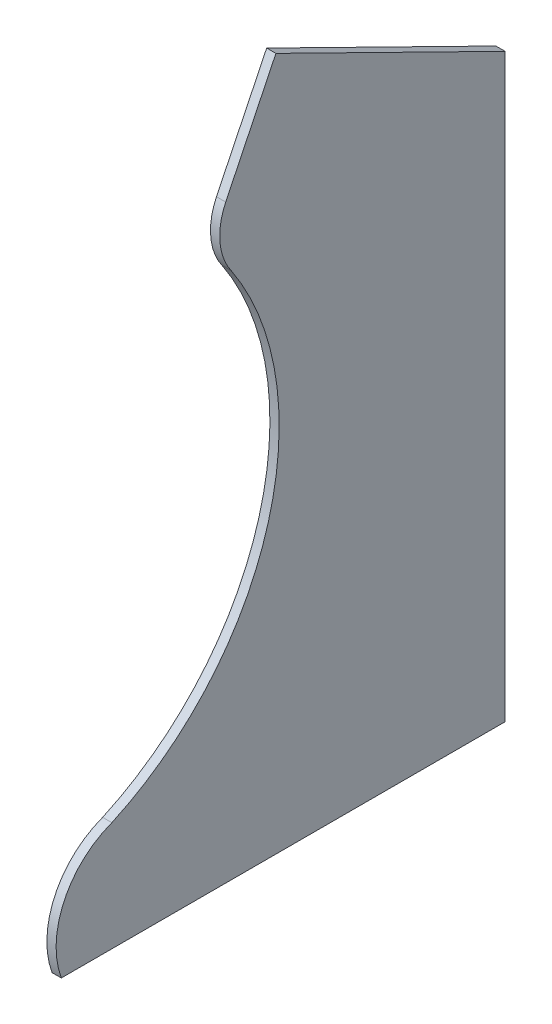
ISO-10303-21;
HEADER;
FILE_DESCRIPTION(('STEP AP214'),'2;1');
FILE_NAME('part.step','',(''),(''),'','','');
FILE_SCHEMA(('AUTOMOTIVE_DESIGN { 1 0 10303 214 1 1 1 1 }'));
ENDSEC;
DATA;
#1=APPLICATION_CONTEXT('core data for automotive mechanical design processes');
#2=APPLICATION_PROTOCOL_DEFINITION('international standard','automotive_design',2000,#1);
#3=PRODUCT_CONTEXT('',#1,'mechanical');
#4=PRODUCT('Part','Part','',(#3));
#5=PRODUCT_RELATED_PRODUCT_CATEGORY('part','',(#4));
#6=PRODUCT_DEFINITION_FORMATION('','',#4);
#7=PRODUCT_DEFINITION_CONTEXT('part definition',#1,'design');
#8=PRODUCT_DEFINITION('design','',#6,#7);
#9=PRODUCT_DEFINITION_SHAPE('','',#8);
#10=(LENGTH_UNIT() NAMED_UNIT(*) SI_UNIT(.MILLI.,.METRE.));
#11=(NAMED_UNIT(*) PLANE_ANGLE_UNIT() SI_UNIT($,.RADIAN.));
#12=(NAMED_UNIT(*) SI_UNIT($,.STERADIAN.) SOLID_ANGLE_UNIT());
#13=UNCERTAINTY_MEASURE_WITH_UNIT(LENGTH_MEASURE(1.E-05),#10,'distance_accuracy_value','');
#14=(GEOMETRIC_REPRESENTATION_CONTEXT(3) GLOBAL_UNCERTAINTY_ASSIGNED_CONTEXT((#13)) GLOBAL_UNIT_ASSIGNED_CONTEXT((#10,
#11,#12)) REPRESENTATION_CONTEXT('',''));
#15=CARTESIAN_POINT('',(0.,0.,0.));
#16=DIRECTION('',(0.,0.,1.));
#17=DIRECTION('',(1.,0.,0.));
#18=AXIS2_PLACEMENT_3D('',#15,#16,#17);
#19=CARTESIAN_POINT('',(10.,-736.54579363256,83.6938727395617));
#20=DIRECTION('',(-1.,0.,0.));
#21=DIRECTION('',(0.,0.,1.));
#22=AXIS2_PLACEMENT_3D('',#19,#20,#21);
#23=CYLINDRICAL_SURFACE('',#22,92.1635376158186);
#24=CARTESIAN_POINT('',(0.,-736.54579363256,83.6938727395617));
#25=DIRECTION('',(1.,0.,0.));
#26=DIRECTION('',(0.,0.,-1.));
#27=AXIS2_PLACEMENT_3D('',#24,#25,#26);
#28=CIRCLE('',#27,92.1635376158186);
#29=CARTESIAN_POINT('',(0.,-650.03330709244,115.469765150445));
#30=VERTEX_POINT('',#29);
#31=CARTESIAN_POINT('',(0.,-768.321686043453,170.206359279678));
#32=VERTEX_POINT('',#31);
#33=EDGE_CURVE('E125',#30,#32,#28,.T.);
#34=ORIENTED_EDGE('',*,*,#33,.T.);
#35=DIRECTION('',(-1.,0.,0.));
#36=VECTOR('',#35,1.);
#37=CARTESIAN_POINT('',(10.,-768.321686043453,170.206359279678));
#38=LINE('',#37,#36);
#39=CARTESIAN_POINT('',(10.,-768.321686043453,170.206359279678));
#40=VERTEX_POINT('',#39);
#41=EDGE_CURVE('E11',#40,#32,#38,.T.);
#42=ORIENTED_EDGE('',*,*,#41,.F.);
#43=CARTESIAN_POINT('',(10.,-736.54579363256,83.6938727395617));
#44=DIRECTION('',(1.,0.,0.));
#45=DIRECTION('',(0.,0.,-1.));
#46=AXIS2_PLACEMENT_3D('',#43,#44,#45);
#47=CIRCLE('',#46,92.1635376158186);
#48=CARTESIAN_POINT('',(10.,-650.03330709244,115.469765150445));
#49=VERTEX_POINT('',#48);
#50=EDGE_CURVE('E137',#49,#40,#47,.T.);
#51=ORIENTED_EDGE('',*,*,#50,.F.);
#52=DIRECTION('',(-1.,0.,0.));
#53=VECTOR('',#52,1.);
#54=CARTESIAN_POINT('',(10.,-650.03330709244,115.469765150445));
#55=LINE('',#54,#53);
#56=EDGE_CURVE('E121',#49,#30,#55,.T.);
#57=ORIENTED_EDGE('',*,*,#56,.T.);
#58=EDGE_LOOP('',(#34,#42,#51,#57));
#59=FACE_BOUND('',#58,.T.);
#60=ADVANCED_FACE('F35',(#59),#23,.T.);
#61=CARTESIAN_POINT('',(10.,-768.321686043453,170.206359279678));
#62=DIRECTION('',(0.,1.,0.));
#63=DIRECTION('',(0.,0.,1.));
#64=AXIS2_PLACEMENT_3D('',#61,#62,#63);
#65=PLANE('',#64);
#66=DIRECTION('',(0.,0.,-1.));
#67=VECTOR('',#66,1.);
#68=CARTESIAN_POINT('',(0.,-768.321686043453,170.206359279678));
#69=LINE('',#68,#67);
#70=CARTESIAN_POINT('',(0.,-768.321686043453,-310.283640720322));
#71=VERTEX_POINT('',#70);
#72=EDGE_CURVE('E128',#32,#71,#69,.T.);
#73=ORIENTED_EDGE('',*,*,#72,.T.);
#74=DIRECTION('',(-1.,0.,0.));
#75=VECTOR('',#74,1.);
#76=CARTESIAN_POINT('',(10.,-768.321686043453,-310.283640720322));
#77=LINE('',#76,#75);
#78=CARTESIAN_POINT('',(10.,-768.321686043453,-310.283640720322));
#79=VERTEX_POINT('',#78);
#80=EDGE_CURVE('E43',#79,#71,#77,.T.);
#81=ORIENTED_EDGE('',*,*,#80,.F.);
#82=DIRECTION('',(0.,0.,-1.));
#83=VECTOR('',#82,1.);
#84=CARTESIAN_POINT('',(10.,-768.321686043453,170.206359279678));
#85=LINE('',#84,#83);
#86=EDGE_CURVE('E91',#40,#79,#85,.T.);
#87=ORIENTED_EDGE('',*,*,#86,.F.);
#88=ORIENTED_EDGE('',*,*,#41,.T.);
#89=EDGE_LOOP('',(#73,#81,#87,#88));
#90=FACE_BOUND('',#89,.T.);
#91=ADVANCED_FACE('F162',(#90),#65,.F.);
#92=CARTESIAN_POINT('',(10.,-768.321686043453,-310.283640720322));
#93=DIRECTION('',(0.,0.,1.));
#94=DIRECTION('',(0.,-1.,0.));
#95=AXIS2_PLACEMENT_3D('',#92,#93,#94);
#96=PLANE('',#95);
#97=DIRECTION('',(0.,1.,0.));
#98=VECTOR('',#97,1.);
#99=CARTESIAN_POINT('',(0.,-768.321686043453,-310.283640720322));
#100=LINE('',#99,#98);
#101=CARTESIAN_POINT('',(0.,-139.724382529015,-310.283640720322));
#102=VERTEX_POINT('',#101);
#103=EDGE_CURVE('E130',#71,#102,#100,.T.);
#104=ORIENTED_EDGE('',*,*,#103,.T.);
#105=DIRECTION('',(-1.,0.,0.));
#106=VECTOR('',#105,1.);
#107=CARTESIAN_POINT('',(10.,-139.724382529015,-310.283640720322));
#108=LINE('',#107,#106);
#109=CARTESIAN_POINT('',(10.,-139.724382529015,-310.283640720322));
#110=VERTEX_POINT('',#109);
#111=EDGE_CURVE('E141',#110,#102,#108,.T.);
#112=ORIENTED_EDGE('',*,*,#111,.F.);
#113=DIRECTION('',(0.,1.,0.));
#114=VECTOR('',#113,1.);
#115=CARTESIAN_POINT('',(10.,-768.321686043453,-310.283640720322));
#116=LINE('',#115,#114);
#117=EDGE_CURVE('E149',#79,#110,#116,.T.);
#118=ORIENTED_EDGE('',*,*,#117,.F.);
#119=ORIENTED_EDGE('',*,*,#80,.T.);
#120=EDGE_LOOP('',(#104,#112,#118,#119));
#121=FACE_BOUND('',#120,.T.);
#122=ADVANCED_FACE('F147',(#121),#96,.F.);
#123=CARTESIAN_POINT('',(10.,-139.724382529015,-310.283640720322));
#124=DIRECTION('',(0.,-0.897183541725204,0.441657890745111));
#125=DIRECTION('',(0.,-0.441657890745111,-0.897183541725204));
#126=AXIS2_PLACEMENT_3D('',#123,#124,#125);
#127=PLANE('',#126);
#128=DIRECTION('',(0.,0.441657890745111,0.897183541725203));
#129=VECTOR('',#128,1.);
#130=CARTESIAN_POINT('',(0.,-139.724382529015,-310.283640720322));
#131=LINE('',#130,#129);
#132=CARTESIAN_POINT('',(0.,-17.5562832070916,-62.1114460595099));
#133=VERTEX_POINT('',#132);
#134=EDGE_CURVE('E132',#102,#133,#131,.T.);
#135=ORIENTED_EDGE('',*,*,#134,.T.);
#136=DIRECTION('',(-1.,0.,0.));
#137=VECTOR('',#136,1.);
#138=CARTESIAN_POINT('',(10.,-17.5562832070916,-62.1114460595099));
#139=LINE('',#138,#137);
#140=CARTESIAN_POINT('',(10.,-17.5562832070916,-62.1114460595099));
#141=VERTEX_POINT('',#140);
#142=EDGE_CURVE('E116',#141,#133,#139,.T.);
#143=ORIENTED_EDGE('',*,*,#142,.F.);
#144=DIRECTION('',(0.,0.441657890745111,0.897183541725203));
#145=VECTOR('',#144,1.);
#146=CARTESIAN_POINT('',(10.,-139.724382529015,-310.283640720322));
#147=LINE('',#146,#145);
#148=EDGE_CURVE('E107',#110,#141,#147,.T.);
#149=ORIENTED_EDGE('',*,*,#148,.F.);
#150=ORIENTED_EDGE('',*,*,#111,.T.);
#151=EDGE_LOOP('',(#135,#143,#149,#150));
#152=FACE_BOUND('',#151,.T.);
#153=ADVANCED_FACE('F155',(#152),#127,.F.);
#154=CARTESIAN_POINT('',(10.,-17.5562832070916,-62.1114460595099));
#155=DIRECTION('',(0.,-0.4359565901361,-0.899967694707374));
#156=DIRECTION('',(0.,0.899967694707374,-0.4359565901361));
#157=AXIS2_PLACEMENT_3D('',#154,#155,#156);
#158=PLANE('',#157);
#159=DIRECTION('',(0.,-0.899967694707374,0.4359565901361));
#160=VECTOR('',#159,1.);
#161=CARTESIAN_POINT('',(0.,-17.5562832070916,-62.1114460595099));
#162=LINE('',#161,#160);
#163=CARTESIAN_POINT('',(0.,-129.765163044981,-7.75593871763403));
#164=VERTEX_POINT('',#163);
#165=EDGE_CURVE('E115',#133,#164,#162,.T.);
#166=ORIENTED_EDGE('',*,*,#165,.T.);
#167=DIRECTION('',(-1.,0.,0.));
#168=VECTOR('',#167,1.);
#169=CARTESIAN_POINT('',(10.,-129.765163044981,-7.75593871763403));
#170=LINE('',#169,#168);
#171=CARTESIAN_POINT('',(10.,-129.765163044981,-7.75593871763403));
#172=VERTEX_POINT('',#171);
#173=EDGE_CURVE('E112',#172,#164,#170,.T.);
#174=ORIENTED_EDGE('',*,*,#173,.F.);
#175=DIRECTION('',(0.,-0.899967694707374,0.4359565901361));
#176=VECTOR('',#175,1.);
#177=CARTESIAN_POINT('',(10.,-17.5562832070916,-62.1114460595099));
#178=LINE('',#177,#176);
#179=EDGE_CURVE('E101',#141,#172,#178,.T.);
#180=ORIENTED_EDGE('',*,*,#179,.F.);
#181=ORIENTED_EDGE('',*,*,#142,.T.);
#182=EDGE_LOOP('',(#166,#174,#180,#181));
#183=FACE_BOUND('',#182,.T.);
#184=ADVANCED_FACE('F113',(#183),#158,.F.);
#185=CARTESIAN_POINT('',(10.,-158.36201272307,-67.6991674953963));
#186=DIRECTION('',(-1.,0.,0.));
#187=DIRECTION('',(0.,0.,1.));
#188=AXIS2_PLACEMENT_3D('',#185,#186,#187);
#189=CYLINDRICAL_SURFACE('',#188,66.4151374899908);
#190=CARTESIAN_POINT('',(0.,-158.36201272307,-67.6991674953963));
#191=DIRECTION('',(1.,0.,0.));
#192=DIRECTION('',(0.,0.,-1.));
#193=AXIS2_PLACEMENT_3D('',#190,#191,#192);
#194=CIRCLE('',#193,66.4151374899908);
#195=CARTESIAN_POINT('',(0.,-197.130043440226,-13.7731971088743));
#196=VERTEX_POINT('',#195);
#197=EDGE_CURVE('E77',#164,#196,#194,.T.);
#198=ORIENTED_EDGE('',*,*,#197,.T.);
#199=DIRECTION('',(-1.,0.,0.));
#200=VECTOR('',#199,1.);
#201=CARTESIAN_POINT('',(10.,-197.130043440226,-13.7731971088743));
#202=LINE('',#201,#200);
#203=CARTESIAN_POINT('',(10.,-197.130043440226,-13.7731971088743));
#204=VERTEX_POINT('',#203);
#205=EDGE_CURVE('E117',#204,#196,#202,.T.);
#206=ORIENTED_EDGE('',*,*,#205,.F.);
#207=CARTESIAN_POINT('',(10.,-158.36201272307,-67.6991674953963));
#208=DIRECTION('',(1.,0.,0.));
#209=DIRECTION('',(0.,0.,-1.));
#210=AXIS2_PLACEMENT_3D('',#207,#208,#209);
#211=CIRCLE('',#210,66.4151374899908);
#212=EDGE_CURVE('E105',#172,#204,#211,.T.);
#213=ORIENTED_EDGE('',*,*,#212,.F.);
#214=ORIENTED_EDGE('',*,*,#173,.T.);
#215=EDGE_LOOP('',(#198,#206,#213,#214));
#216=FACE_BOUND('',#215,.T.);
#217=ADVANCED_FACE('F119',(#216),#189,.T.);
#218=CARTESIAN_POINT('',(10.,-368.560271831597,243.658575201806));
#219=DIRECTION('',(-1.,0.,0.));
#220=DIRECTION('',(0.,0.,1.));
#221=AXIS2_PLACEMENT_3D('',#218,#219,#220);
#222=CYLINDRICAL_SURFACE('',#221,309.288604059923);
#223=CARTESIAN_POINT('',(0.,-368.560271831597,243.658575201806));
#224=DIRECTION('',(-1.,0.,0.));
#225=DIRECTION('',(0.,0.,1.));
#226=AXIS2_PLACEMENT_3D('',#223,#224,#225);
#227=CIRCLE('',#226,309.288604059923);
#228=EDGE_CURVE('E83',#196,#30,#227,.T.);
#229=ORIENTED_EDGE('',*,*,#228,.T.);
#230=ORIENTED_EDGE('',*,*,#56,.F.);
#231=CARTESIAN_POINT('',(10.,-368.560271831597,243.658575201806));
#232=DIRECTION('',(-1.,0.,0.));
#233=DIRECTION('',(0.,0.,1.));
#234=AXIS2_PLACEMENT_3D('',#231,#232,#233);
#235=CIRCLE('',#234,309.288604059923);
#236=EDGE_CURVE('E51',#204,#49,#235,.T.);
#237=ORIENTED_EDGE('',*,*,#236,.F.);
#238=ORIENTED_EDGE('',*,*,#205,.T.);
#239=EDGE_LOOP('',(#229,#230,#237,#238));
#240=FACE_BOUND('',#239,.T.);
#241=ADVANCED_FACE('F176',(#240),#222,.F.);
#242=CARTESIAN_POINT('',(10.,-736.54579363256,83.6938727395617));
#243=DIRECTION('',(1.,0.,0.));
#244=DIRECTION('',(0.,0.,-1.));
#245=AXIS2_PLACEMENT_3D('',#242,#243,#244);
#246=PLANE('',#245);
#247=ORIENTED_EDGE('',*,*,#50,.T.);
#248=ORIENTED_EDGE('',*,*,#86,.T.);
#249=ORIENTED_EDGE('',*,*,#117,.T.);
#250=ORIENTED_EDGE('',*,*,#148,.T.);
#251=ORIENTED_EDGE('',*,*,#179,.T.);
#252=ORIENTED_EDGE('',*,*,#212,.T.);
#253=ORIENTED_EDGE('',*,*,#236,.T.);
#254=EDGE_LOOP('',(#247,#248,#249,#250,#251,#252,#253));
#255=FACE_BOUND('',#254,.T.);
#256=ADVANCED_FACE('F103',(#255),#246,.T.);
#257=CARTESIAN_POINT('',(0.,-736.54579363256,83.6938727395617));
#258=DIRECTION('',(1.,0.,0.));
#259=DIRECTION('',(0.,0.,-1.));
#260=AXIS2_PLACEMENT_3D('',#257,#258,#259);
#261=PLANE('',#260);
#262=ORIENTED_EDGE('',*,*,#33,.F.);
#263=ORIENTED_EDGE('',*,*,#228,.F.);
#264=ORIENTED_EDGE('',*,*,#197,.F.);
#265=ORIENTED_EDGE('',*,*,#165,.F.);
#266=ORIENTED_EDGE('',*,*,#134,.F.);
#267=ORIENTED_EDGE('',*,*,#103,.F.);
#268=ORIENTED_EDGE('',*,*,#72,.F.);
#269=EDGE_LOOP('',(#262,#263,#264,#265,#266,#267,#268));
#270=FACE_BOUND('',#269,.T.);
#271=ADVANCED_FACE('F153',(#270),#261,.F.);
#272=CLOSED_SHELL('',(#60,#91,#122,#153,#184,#217,#241,#256,#271));
#273=MANIFOLD_SOLID_BREP('B2',#272);
#274=ADVANCED_BREP_SHAPE_REPRESENTATION('',(#18,#273),#14);
#275=SHAPE_DEFINITION_REPRESENTATION(#9,#274);
ENDSEC;
END-ISO-10303-21;
